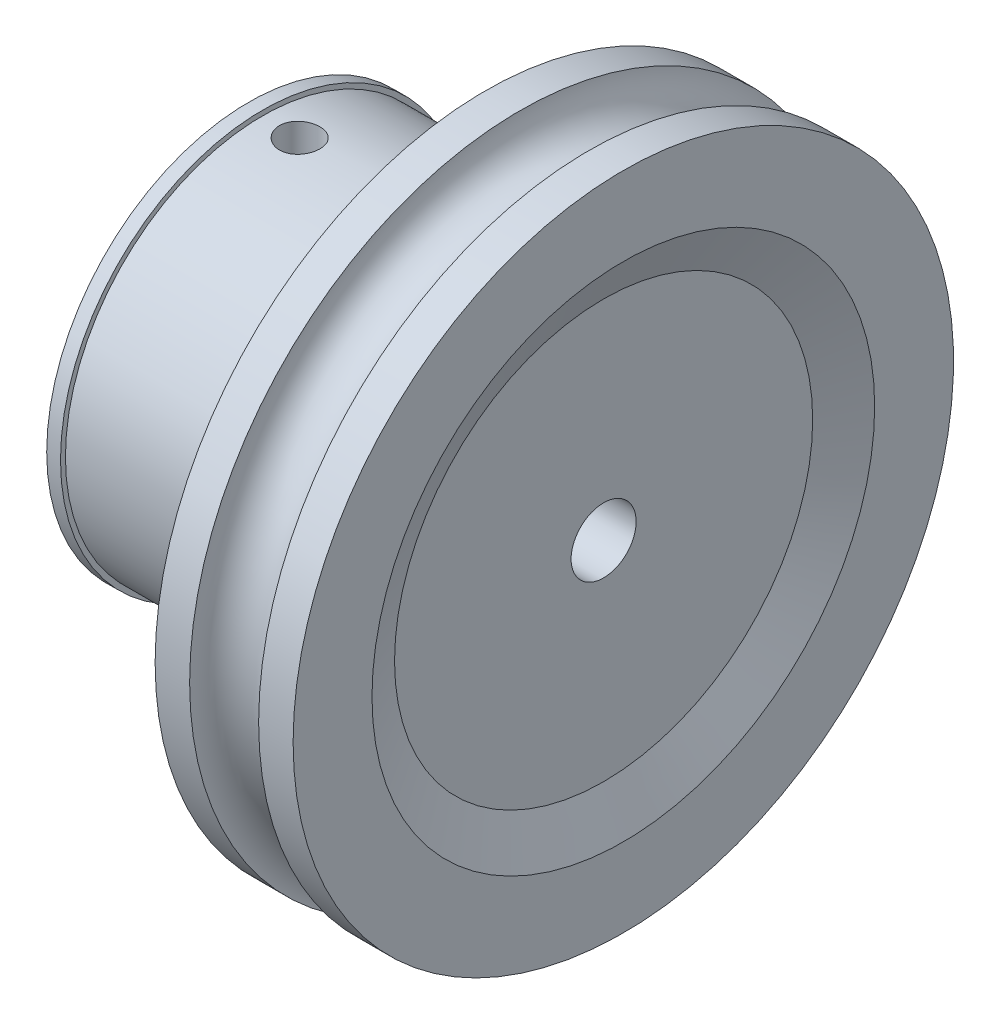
ISO-10303-21;
HEADER;
FILE_DESCRIPTION(('STEP AP214'),'2;1');
FILE_NAME('part.step','',(''),(''),'','','');
FILE_SCHEMA(('AUTOMOTIVE_DESIGN { 1 0 10303 214 1 1 1 1 }'));
ENDSEC;
DATA;
#1=APPLICATION_CONTEXT('core data for automotive mechanical design processes');
#2=APPLICATION_PROTOCOL_DEFINITION('international standard','automotive_design',2000,#1);
#3=PRODUCT_CONTEXT('',#1,'mechanical');
#4=PRODUCT('Part','Part','',(#3));
#5=PRODUCT_RELATED_PRODUCT_CATEGORY('part','',(#4));
#6=PRODUCT_DEFINITION_FORMATION('','',#4);
#7=PRODUCT_DEFINITION_CONTEXT('part definition',#1,'design');
#8=PRODUCT_DEFINITION('design','',#6,#7);
#9=PRODUCT_DEFINITION_SHAPE('','',#8);
#10=(LENGTH_UNIT() NAMED_UNIT(*) SI_UNIT(.MILLI.,.METRE.));
#11=(NAMED_UNIT(*) PLANE_ANGLE_UNIT() SI_UNIT($,.RADIAN.));
#12=(NAMED_UNIT(*) SI_UNIT($,.STERADIAN.) SOLID_ANGLE_UNIT());
#13=UNCERTAINTY_MEASURE_WITH_UNIT(LENGTH_MEASURE(1.E-05),#10,'distance_accuracy_value','');
#14=(GEOMETRIC_REPRESENTATION_CONTEXT(3) GLOBAL_UNCERTAINTY_ASSIGNED_CONTEXT((#13)) GLOBAL_UNIT_ASSIGNED_CONTEXT((#10,
#11,#12)) REPRESENTATION_CONTEXT('',''));
#15=CARTESIAN_POINT('',(0.,0.,0.));
#16=DIRECTION('',(0.,0.,1.));
#17=DIRECTION('',(1.,0.,0.));
#18=AXIS2_PLACEMENT_3D('',#15,#16,#17);
#19=CARTESIAN_POINT('',(18.,10.6054930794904,0.));
#20=DIRECTION('',(-1.,0.,0.));
#21=DIRECTION('',(0.,0.,1.));
#22=AXIS2_PLACEMENT_3D('',#19,#20,#21);
#23=PLANE('',#22);
#24=CARTESIAN_POINT('',(18.,0.,0.));
#25=DIRECTION('',(1.,0.,0.));
#26=DIRECTION('',(0.,0.,-1.));
#27=AXIS2_PLACEMENT_3D('',#24,#25,#26);
#28=CIRCLE('',#27,1.65);
#29=CARTESIAN_POINT('',(18.,0.,-1.65));
#30=VERTEX_POINT('',#29);
#31=EDGE_CURVE('E68',#30,#30,#28,.T.);
#32=ORIENTED_EDGE('',*,*,#31,.F.);
#33=EDGE_LOOP('',(#32));
#34=FACE_BOUND('',#33,.T.);
#35=CARTESIAN_POINT('',(18.,0.,0.));
#36=DIRECTION('',(-1.,0.,0.));
#37=DIRECTION('',(0.,0.,1.));
#38=AXIS2_PLACEMENT_3D('',#35,#36,#37);
#39=CIRCLE('',#38,10.6054930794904);
#40=CARTESIAN_POINT('',(18.,0.,10.6054930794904));
#41=VERTEX_POINT('',#40);
#42=EDGE_CURVE('E9',#41,#41,#39,.T.);
#43=ORIENTED_EDGE('',*,*,#42,.F.);
#44=EDGE_LOOP('',(#43));
#45=FACE_BOUND('',#44,.T.);
#46=ADVANCED_FACE('F15',(#34,#45),#23,.F.);
#47=CARTESIAN_POINT('',(18.,0.,0.));
#48=DIRECTION('',(1.,0.,0.));
#49=DIRECTION('',(0.,0.,-1.));
#50=AXIS2_PLACEMENT_3D('',#47,#48,#49);
#51=CONICAL_SURFACE('',#50,10.6054930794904,1.13446401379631);
#52=CARTESIAN_POINT('',(19.,0.,0.));
#53=DIRECTION('',(-1.,0.,0.));
#54=DIRECTION('',(0.,0.,1.));
#55=AXIS2_PLACEMENT_3D('',#52,#53,#54);
#56=CIRCLE('',#55,12.75);
#57=CARTESIAN_POINT('',(19.,0.,12.75));
#58=VERTEX_POINT('',#57);
#59=EDGE_CURVE('E26',#58,#58,#56,.T.);
#60=ORIENTED_EDGE('',*,*,#59,.F.);
#61=EDGE_LOOP('',(#60));
#62=FACE_BOUND('',#61,.T.);
#63=ORIENTED_EDGE('',*,*,#42,.T.);
#64=EDGE_LOOP('',(#63));
#65=FACE_BOUND('',#64,.T.);
#66=ADVANCED_FACE('F110',(#62,#65),#51,.F.);
#67=CARTESIAN_POINT('',(19.,16.75,0.));
#68=DIRECTION('',(-1.,0.,0.));
#69=DIRECTION('',(0.,0.,1.));
#70=AXIS2_PLACEMENT_3D('',#67,#68,#69);
#71=PLANE('',#70);
#72=CARTESIAN_POINT('',(19.,0.,0.));
#73=DIRECTION('',(-1.,0.,0.));
#74=DIRECTION('',(0.,0.,1.));
#75=AXIS2_PLACEMENT_3D('',#72,#73,#74);
#76=CIRCLE('',#75,16.75);
#77=CARTESIAN_POINT('',(19.,0.,16.75));
#78=VERTEX_POINT('',#77);
#79=EDGE_CURVE('E30',#78,#78,#76,.T.);
#80=ORIENTED_EDGE('',*,*,#79,.F.);
#81=EDGE_LOOP('',(#80));
#82=FACE_BOUND('',#81,.T.);
#83=ORIENTED_EDGE('',*,*,#59,.T.);
#84=EDGE_LOOP('',(#83));
#85=FACE_BOUND('',#84,.T.);
#86=ADVANCED_FACE('F116',(#82,#85),#71,.F.);
#87=CARTESIAN_POINT('',(0.,0.,0.));
#88=DIRECTION('',(-1.,0.,0.));
#89=DIRECTION('',(0.,0.,1.));
#90=AXIS2_PLACEMENT_3D('',#87,#88,#89);
#91=CYLINDRICAL_SURFACE('',#90,16.75);
#92=CARTESIAN_POINT('',(17.25,0.,0.));
#93=DIRECTION('',(-1.,0.,0.));
#94=DIRECTION('',(0.,0.,1.));
#95=AXIS2_PLACEMENT_3D('',#92,#93,#94);
#96=CIRCLE('',#95,16.75);
#97=CARTESIAN_POINT('',(17.25,0.,16.75));
#98=VERTEX_POINT('',#97);
#99=EDGE_CURVE('E35',#98,#98,#96,.T.);
#100=ORIENTED_EDGE('',*,*,#99,.F.);
#101=EDGE_LOOP('',(#100));
#102=FACE_BOUND('',#101,.T.);
#103=ORIENTED_EDGE('',*,*,#79,.T.);
#104=EDGE_LOOP('',(#103));
#105=FACE_BOUND('',#104,.T.);
#106=ADVANCED_FACE('F125',(#102,#105),#91,.T.);
#107=CARTESIAN_POINT('',(15.5,0.,0.));
#108=DIRECTION('',(-1.,0.,0.));
#109=DIRECTION('',(0.,0.,1.));
#110=AXIS2_PLACEMENT_3D('',#107,#108,#109);
#111=TOROIDAL_SURFACE('',#110,16.75,1.75);
#112=CARTESIAN_POINT('',(13.75,0.,0.));
#113=DIRECTION('',(-1.,0.,0.));
#114=DIRECTION('',(0.,0.,1.));
#115=AXIS2_PLACEMENT_3D('',#112,#113,#114);
#116=CIRCLE('',#115,16.75);
#117=CARTESIAN_POINT('',(13.75,0.,16.75));
#118=VERTEX_POINT('',#117);
#119=EDGE_CURVE('E38',#118,#118,#116,.T.);
#120=ORIENTED_EDGE('',*,*,#119,.F.);
#121=EDGE_LOOP('',(#120));
#122=FACE_BOUND('',#121,.T.);
#123=ORIENTED_EDGE('',*,*,#99,.T.);
#124=EDGE_LOOP('',(#123));
#125=FACE_BOUND('',#124,.T.);
#126=ADVANCED_FACE('F132',(#122,#125),#111,.F.);
#127=CARTESIAN_POINT('',(0.,0.,0.));
#128=DIRECTION('',(-1.,0.,0.));
#129=DIRECTION('',(0.,0.,1.));
#130=AXIS2_PLACEMENT_3D('',#127,#128,#129);
#131=CYLINDRICAL_SURFACE('',#130,16.75);
#132=CARTESIAN_POINT('',(12.,0.,0.));
#133=DIRECTION('',(-1.,0.,0.));
#134=DIRECTION('',(0.,0.,1.));
#135=AXIS2_PLACEMENT_3D('',#132,#133,#134);
#136=CIRCLE('',#135,16.75);
#137=CARTESIAN_POINT('',(12.,0.,16.75));
#138=VERTEX_POINT('',#137);
#139=EDGE_CURVE('E41',#138,#138,#136,.T.);
#140=ORIENTED_EDGE('',*,*,#139,.F.);
#141=EDGE_LOOP('',(#140));
#142=FACE_BOUND('',#141,.T.);
#143=ORIENTED_EDGE('',*,*,#119,.T.);
#144=EDGE_LOOP('',(#143));
#145=FACE_BOUND('',#144,.T.);
#146=ADVANCED_FACE('F136',(#142,#145),#131,.T.);
#147=CARTESIAN_POINT('',(12.,14.3,0.));
#148=DIRECTION('',(1.,0.,0.));
#149=DIRECTION('',(0.,0.,-1.));
#150=AXIS2_PLACEMENT_3D('',#147,#148,#149);
#151=PLANE('',#150);
#152=CARTESIAN_POINT('',(12.,0.,0.));
#153=DIRECTION('',(-1.,0.,0.));
#154=DIRECTION('',(0.,0.,1.));
#155=AXIS2_PLACEMENT_3D('',#152,#153,#154);
#156=CIRCLE('',#155,14.3);
#157=CARTESIAN_POINT('',(12.,0.,14.3));
#158=VERTEX_POINT('',#157);
#159=EDGE_CURVE('E44',#158,#158,#156,.T.);
#160=ORIENTED_EDGE('',*,*,#159,.F.);
#161=EDGE_LOOP('',(#160));
#162=FACE_BOUND('',#161,.T.);
#163=ORIENTED_EDGE('',*,*,#139,.T.);
#164=EDGE_LOOP('',(#163));
#165=FACE_BOUND('',#164,.T.);
#166=ADVANCED_FACE('F140',(#162,#165),#151,.F.);
#167=CARTESIAN_POINT('',(12.,0.,0.));
#168=DIRECTION('',(1.,0.,0.));
#169=DIRECTION('',(0.,0.,-1.));
#170=AXIS2_PLACEMENT_3D('',#167,#168,#169);
#171=CONICAL_SURFACE('',#170,14.3,0.785398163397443);
#172=CARTESIAN_POINT('',(9.7,0.,0.));
#173=DIRECTION('',(-1.,0.,0.));
#174=DIRECTION('',(0.,0.,1.));
#175=AXIS2_PLACEMENT_3D('',#172,#173,#174);
#176=CIRCLE('',#175,12.);
#177=CARTESIAN_POINT('',(9.7,0.,12.));
#178=VERTEX_POINT('',#177);
#179=EDGE_CURVE('E47',#178,#178,#176,.T.);
#180=ORIENTED_EDGE('',*,*,#179,.F.);
#181=EDGE_LOOP('',(#180));
#182=FACE_BOUND('',#181,.T.);
#183=ORIENTED_EDGE('',*,*,#159,.T.);
#184=EDGE_LOOP('',(#183));
#185=FACE_BOUND('',#184,.T.);
#186=ADVANCED_FACE('F144',(#182,#185),#171,.T.);
#187=CARTESIAN_POINT('',(0.,0.,0.));
#188=DIRECTION('',(-1.,0.,0.));
#189=DIRECTION('',(0.,0.,1.));
#190=AXIS2_PLACEMENT_3D('',#187,#188,#189);
#191=CYLINDRICAL_SURFACE('',#190,12.);
#192=CARTESIAN_POINT('',(8.7,0.,0.));
#193=DIRECTION('',(-1.,0.,0.));
#194=DIRECTION('',(0.,0.,1.));
#195=AXIS2_PLACEMENT_3D('',#192,#193,#194);
#196=CIRCLE('',#195,12.);
#197=CARTESIAN_POINT('',(8.7,0.,12.));
#198=VERTEX_POINT('',#197);
#199=EDGE_CURVE('E50',#198,#198,#196,.T.);
#200=ORIENTED_EDGE('',*,*,#199,.F.);
#201=EDGE_LOOP('',(#200));
#202=FACE_BOUND('',#201,.T.);
#203=ORIENTED_EDGE('',*,*,#179,.T.);
#204=EDGE_LOOP('',(#203));
#205=FACE_BOUND('',#204,.T.);
#206=ADVANCED_FACE('F148',(#202,#205),#191,.T.);
#207=CARTESIAN_POINT('',(8.7,10.,0.));
#208=DIRECTION('',(1.,0.,0.));
#209=DIRECTION('',(0.,0.,-1.));
#210=AXIS2_PLACEMENT_3D('',#207,#208,#209);
#211=PLANE('',#210);
#212=CARTESIAN_POINT('',(8.7,0.,0.));
#213=DIRECTION('',(-1.,0.,0.));
#214=DIRECTION('',(0.,0.,1.));
#215=AXIS2_PLACEMENT_3D('',#212,#213,#214);
#216=CIRCLE('',#215,10.);
#217=CARTESIAN_POINT('',(8.7,0.,10.));
#218=VERTEX_POINT('',#217);
#219=EDGE_CURVE('E53',#218,#218,#216,.T.);
#220=ORIENTED_EDGE('',*,*,#219,.F.);
#221=EDGE_LOOP('',(#220));
#222=FACE_BOUND('',#221,.T.);
#223=ORIENTED_EDGE('',*,*,#199,.T.);
#224=EDGE_LOOP('',(#223));
#225=FACE_BOUND('',#224,.T.);
#226=ADVANCED_FACE('F105',(#222,#225),#211,.F.);
#227=CARTESIAN_POINT('',(0.,0.,0.));
#228=DIRECTION('',(-1.,0.,0.));
#229=DIRECTION('',(0.,0.,1.));
#230=AXIS2_PLACEMENT_3D('',#227,#228,#229);
#231=CYLINDRICAL_SURFACE('',#230,10.);
#232=CARTESIAN_POINT('',(2.58364123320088,9.94733004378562,1.025));
#233=CARTESIAN_POINT('',(2.52622902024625,9.94733073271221,1.02499751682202));
#234=CARTESIAN_POINT('',(2.46877903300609,9.94783244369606,1.02016009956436));
#235=CARTESIAN_POINT('',(2.35547242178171,9.94978475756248,1.00093607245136));
#236=CARTESIAN_POINT('',(2.29961761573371,9.95123640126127,0.986538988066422));
#237=CARTESIAN_POINT('',(2.19115859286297,9.95492246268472,0.948619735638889));
#238=CARTESIAN_POINT('',(2.13855240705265,9.9571564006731,0.925103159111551));
#239=CARTESIAN_POINT('',(2.03804502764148,9.96215475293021,0.869623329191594));
#240=CARTESIAN_POINT('',(1.99014291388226,9.96491906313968,0.837661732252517));
#241=CARTESIAN_POINT('',(1.90020957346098,9.97067849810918,0.76606825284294));
#242=CARTESIAN_POINT('',(1.85819881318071,9.97367437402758,0.726410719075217));
#243=CARTESIAN_POINT('',(1.78141699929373,9.97955256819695,0.640605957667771));
#244=CARTESIAN_POINT('',(1.74664627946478,9.98243488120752,0.594458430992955));
#245=CARTESIAN_POINT('',(1.6852605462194,9.9877686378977,0.496857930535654));
#246=CARTESIAN_POINT('',(1.65866368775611,9.99021911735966,0.445393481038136));
#247=CARTESIAN_POINT('',(1.61449682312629,9.99440492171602,0.338699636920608));
#248=CARTESIAN_POINT('',(1.59692658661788,9.99614026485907,0.283470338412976));
#249=CARTESIAN_POINT('',(1.57137186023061,9.9986949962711,0.171021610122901));
#250=CARTESIAN_POINT('',(1.56335371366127,9.9995175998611,0.113809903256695));
#251=CARTESIAN_POINT('',(1.55702661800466,10.0001651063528,-0.0011526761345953));
#252=CARTESIAN_POINT('',(1.55871740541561,9.99999003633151,-0.0589035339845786));
#253=CARTESIAN_POINT('',(1.57173289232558,9.99866455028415,-0.173076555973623));
#254=CARTESIAN_POINT('',(1.58302140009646,9.99751779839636,-0.229502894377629));
#255=CARTESIAN_POINT('',(1.61485548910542,9.99438201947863,-0.339655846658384));
#256=CARTESIAN_POINT('',(1.63540119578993,9.99239298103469,-0.393382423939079));
#257=CARTESIAN_POINT('',(1.68520603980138,9.98778993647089,-0.496724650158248));
#258=CARTESIAN_POINT('',(1.71448116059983,9.98517478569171,-0.546332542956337));
#259=CARTESIAN_POINT('',(1.780902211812,9.97961288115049,-0.639944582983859));
#260=CARTESIAN_POINT('',(1.81804838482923,9.9766661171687,-0.683948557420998));
#261=CARTESIAN_POINT('',(1.89936056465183,9.97075560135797,-0.76531568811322));
#262=CARTESIAN_POINT('',(1.94355806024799,9.96779183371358,-0.80264738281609));
#263=CARTESIAN_POINT('',(2.03760919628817,9.96219485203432,-0.869366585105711));
#264=CARTESIAN_POINT('',(2.08746284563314,9.95956163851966,-0.898754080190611));
#265=CARTESIAN_POINT('',(2.19143565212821,9.95492369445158,-0.948750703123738));
#266=CARTESIAN_POINT('',(2.24555577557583,9.95291910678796,-0.969357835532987));
#267=CARTESIAN_POINT('',(2.35651307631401,9.94976831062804,-1.00118360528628));
#268=CARTESIAN_POINT('',(2.4133501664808,9.94862207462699,-1.0124025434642));
#269=CARTESIAN_POINT('',(2.52785165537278,9.94732254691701,-1.02509288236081));
#270=CARTESIAN_POINT('',(2.58551112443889,9.94716476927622,-1.02660832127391));
#271=CARTESIAN_POINT('',(2.70026317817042,9.94784818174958,-1.01996434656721));
#272=CARTESIAN_POINT('',(2.75735577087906,9.94868935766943,-1.01180507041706));
#273=CARTESIAN_POINT('',(2.86922473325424,9.95127181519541,-0.986080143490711));
#274=CARTESIAN_POINT('',(2.92400595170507,9.95301109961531,-0.968535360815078));
#275=CARTESIAN_POINT('',(3.02984793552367,9.95719217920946,-0.924558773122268));
#276=CARTESIAN_POINT('',(3.08090861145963,9.9596339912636,-0.898126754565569));
#277=CARTESIAN_POINT('',(3.17806067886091,9.96495584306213,-0.837015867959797));
#278=CARTESIAN_POINT('',(3.22413364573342,9.96783741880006,-0.802307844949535));
#279=CARTESIAN_POINT('',(3.30981551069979,9.97370910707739,-0.725671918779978));
#280=CARTESIAN_POINT('',(3.34942424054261,9.97669922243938,-0.68374382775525));
#281=CARTESIAN_POINT('',(3.42120540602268,9.98246464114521,-0.593666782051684));
#282=CARTESIAN_POINT('',(3.45334909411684,9.98523908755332,-0.545494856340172));
#283=CARTESIAN_POINT('',(3.50908981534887,9.9902480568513,-0.44441086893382));
#284=CARTESIAN_POINT('',(3.53268697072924,9.99248258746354,-0.391498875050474));
#285=CARTESIAN_POINT('',(3.5706161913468,9.99615608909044,-0.28253664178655));
#286=CARTESIAN_POINT('',(3.58496555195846,9.99759654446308,-0.226492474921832));
#287=CARTESIAN_POINT('',(3.6040482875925,9.99952569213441,-0.112774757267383));
#288=CARTESIAN_POINT('',(3.60878194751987,10.0000144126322,-0.0551012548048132));
#289=CARTESIAN_POINT('',(3.60849478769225,9.99998499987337,0.0599557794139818));
#290=CARTESIAN_POINT('',(3.60351856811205,9.99947147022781,0.117339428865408));
#291=CARTESIAN_POINT('',(3.58404651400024,9.9975043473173,0.230450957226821));
#292=CARTESIAN_POINT('',(3.56955067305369,9.99605075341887,0.286178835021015));
#293=CARTESIAN_POINT('',(3.53146337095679,9.99236633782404,0.394396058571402));
#294=CARTESIAN_POINT('',(3.50787329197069,9.99013563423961,0.446885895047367));
#295=CARTESIAN_POINT('',(3.45227188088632,9.98514550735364,0.547168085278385));
#296=CARTESIAN_POINT('',(3.42026058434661,9.98238608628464,0.594960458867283));
#297=CARTESIAN_POINT('',(3.34855833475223,9.97663240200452,0.684719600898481));
#298=CARTESIAN_POINT('',(3.30883416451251,9.97363715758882,0.726659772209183));
#299=CARTESIAN_POINT('',(3.22289976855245,9.9677576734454,0.803298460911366));
#300=CARTESIAN_POINT('',(3.17668799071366,9.96487346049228,0.837995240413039));
#301=CARTESIAN_POINT('',(3.07895498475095,9.95953439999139,0.899235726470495));
#302=CARTESIAN_POINT('',(3.02741997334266,9.95708071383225,0.925757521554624));
#303=CARTESIAN_POINT('',(2.92063534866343,9.95289433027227,0.969735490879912));
#304=CARTESIAN_POINT('',(2.86538999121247,9.95116082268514,0.987201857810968));
#305=CARTESIAN_POINT('',(2.77213531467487,9.94904678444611,1.00823313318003));
#306=CARTESIAN_POINT('',(2.73472153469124,9.94840606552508,1.01451207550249));
#307=CARTESIAN_POINT('',(2.65942439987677,9.94754746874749,1.02289631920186));
#308=CARTESIAN_POINT('',(2.62154104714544,9.94732958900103,1.02500163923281));
#309=CARTESIAN_POINT('',(2.58364123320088,9.94733004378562,1.025));
#310=B_SPLINE_CURVE_WITH_KNOTS('',3,(#232,#233,#234,#235,#236,#237,#238,#239,#240,#241,#242,
#243,#244,#245,#246,#247,#248,#249,#250,#251,#252,#253,#254,#255,#256,#257,#258,#259,#260,#261,
#262,#263,#264,#265,#266,#267,#268,#269,#270,#271,#272,#273,#274,#275,#276,#277,#278,#279,#280,
#281,#282,#283,#284,#285,#286,#287,#288,#289,#290,#291,#292,#293,#294,#295,#296,#297,#298,#299,
#300,#301,#302,#303,#304,#305,#306,#307,#308,#309),.UNSPECIFIED.,.T.,.F.,(4,2,2,2,2,2,2,2,2,2,2,
2,2,2,2,2,2,2,2,2,2,2,2,2,2,2,2,2,2,2,2,2,2,2,2,2,2,2,4),(0.,0.172098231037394,0.34438534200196,
0.516566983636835,0.688714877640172,0.861446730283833,1.03418654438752,1.20730730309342,
1.38042364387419,1.55292818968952,1.72542805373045,1.89728031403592,2.06913490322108,
2.2413061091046,2.41348262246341,2.5864507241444,2.75941909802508,2.93242676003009,
3.10542887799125,3.27764528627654,3.44985924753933,3.6216918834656,3.79352864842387,
3.96597994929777,4.13843573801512,4.31154502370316,4.48465183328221,4.65743394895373,
4.83021094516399,5.00219619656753,5.17418156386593,5.34614080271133,5.51809931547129,
5.69081552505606,5.86357312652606,6.03678982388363,6.209811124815,6.3234197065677,
6.43702778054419),.UNSPECIFIED.);
#311=CARTESIAN_POINT('',(2.58364123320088,9.94733004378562,1.025));
#312=VERTEX_POINT('',#311);
#313=EDGE_CURVE('E71',#312,#312,#310,.T.);
#314=ORIENTED_EDGE('',*,*,#313,.T.);
#315=EDGE_LOOP('',(#314));
#316=FACE_BOUND('',#315,.T.);
#317=CARTESIAN_POINT('',(0.7,0.,0.));
#318=DIRECTION('',(-1.,0.,0.));
#319=DIRECTION('',(0.,0.,1.));
#320=AXIS2_PLACEMENT_3D('',#317,#318,#319);
#321=CIRCLE('',#320,10.);
#322=CARTESIAN_POINT('',(0.7,0.,10.));
#323=VERTEX_POINT('',#322);
#324=EDGE_CURVE('E56',#323,#323,#321,.T.);
#325=ORIENTED_EDGE('',*,*,#324,.F.);
#326=EDGE_LOOP('',(#325));
#327=FACE_BOUND('',#326,.T.);
#328=ORIENTED_EDGE('',*,*,#219,.T.);
#329=EDGE_LOOP('',(#328));
#330=FACE_BOUND('',#329,.T.);
#331=ADVANCED_FACE('F76',(#316,#327,#330),#231,.T.);
#332=CARTESIAN_POINT('',(0.7,10.25,0.));
#333=DIRECTION('',(-1.,0.,0.));
#334=DIRECTION('',(0.,0.,1.));
#335=AXIS2_PLACEMENT_3D('',#332,#333,#334);
#336=PLANE('',#335);
#337=CARTESIAN_POINT('',(0.7,0.,0.));
#338=DIRECTION('',(-1.,0.,0.));
#339=DIRECTION('',(0.,0.,1.));
#340=AXIS2_PLACEMENT_3D('',#337,#338,#339);
#341=CIRCLE('',#340,10.25);
#342=CARTESIAN_POINT('',(0.7,0.,10.25));
#343=VERTEX_POINT('',#342);
#344=EDGE_CURVE('E59',#343,#343,#341,.T.);
#345=ORIENTED_EDGE('',*,*,#344,.F.);
#346=EDGE_LOOP('',(#345));
#347=FACE_BOUND('',#346,.T.);
#348=ORIENTED_EDGE('',*,*,#324,.T.);
#349=EDGE_LOOP('',(#348));
#350=FACE_BOUND('',#349,.T.);
#351=ADVANCED_FACE('F96',(#347,#350),#336,.F.);
#352=CARTESIAN_POINT('',(0.,0.,0.));
#353=DIRECTION('',(-1.,0.,0.));
#354=DIRECTION('',(0.,0.,1.));
#355=AXIS2_PLACEMENT_3D('',#352,#353,#354);
#356=CYLINDRICAL_SURFACE('',#355,10.25);
#357=CARTESIAN_POINT('',(0.,0.,0.));
#358=DIRECTION('',(-1.,0.,0.));
#359=DIRECTION('',(0.,0.,1.));
#360=AXIS2_PLACEMENT_3D('',#357,#358,#359);
#361=CIRCLE('',#360,10.25);
#362=CARTESIAN_POINT('',(0.,0.,10.25));
#363=VERTEX_POINT('',#362);
#364=EDGE_CURVE('E62',#363,#363,#361,.T.);
#365=ORIENTED_EDGE('',*,*,#364,.F.);
#366=EDGE_LOOP('',(#365));
#367=FACE_BOUND('',#366,.T.);
#368=ORIENTED_EDGE('',*,*,#344,.T.);
#369=EDGE_LOOP('',(#368));
#370=FACE_BOUND('',#369,.T.);
#371=ADVANCED_FACE('F93',(#367,#370),#356,.T.);
#372=CARTESIAN_POINT('',(0.,0.,0.));
#373=DIRECTION('',(1.,0.,0.));
#374=DIRECTION('',(0.,0.,-1.));
#375=AXIS2_PLACEMENT_3D('',#372,#373,#374);
#376=PLANE('',#375);
#377=CARTESIAN_POINT('',(0.,0.,0.));
#378=DIRECTION('',(1.,0.,0.));
#379=DIRECTION('',(0.,0.,-1.));
#380=AXIS2_PLACEMENT_3D('',#377,#378,#379);
#381=CIRCLE('',#380,1.65);
#382=CARTESIAN_POINT('',(0.,0.,-1.65));
#383=VERTEX_POINT('',#382);
#384=EDGE_CURVE('E65',#383,#383,#381,.T.);
#385=ORIENTED_EDGE('',*,*,#384,.T.);
#386=EDGE_LOOP('',(#385));
#387=FACE_BOUND('',#386,.T.);
#388=ORIENTED_EDGE('',*,*,#364,.T.);
#389=EDGE_LOOP('',(#388));
#390=FACE_BOUND('',#389,.T.);
#391=ADVANCED_FACE('F89',(#387,#390),#376,.F.);
#392=CARTESIAN_POINT('',(18.,0.,0.));
#393=DIRECTION('',(1.,0.,0.));
#394=DIRECTION('',(0.,0.,-1.));
#395=AXIS2_PLACEMENT_3D('',#392,#393,#394);
#396=CYLINDRICAL_SURFACE('',#395,1.65);
#397=CARTESIAN_POINT('',(2.58364123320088,1.29301005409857,1.025));
#398=CARTESIAN_POINT('',(2.6346598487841,1.29301662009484,1.0249958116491));
#399=CARTESIAN_POINT('',(2.685761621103,1.29608590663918,1.02115613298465));
#400=CARTESIAN_POINT('',(2.78625243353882,1.30782676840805,1.00606826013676));
#401=CARTESIAN_POINT('',(2.83563629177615,1.31651396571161,0.994799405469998));
#402=CARTESIAN_POINT('',(2.93093188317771,1.33803746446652,0.965648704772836));
#403=CARTESIAN_POINT('',(2.97686943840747,1.35083807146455,0.947823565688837));
#404=CARTESIAN_POINT('',(3.06504339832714,1.3790846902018,0.906231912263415));
#405=CARTESIAN_POINT('',(3.1072797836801,1.3945307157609,0.882465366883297));
#406=CARTESIAN_POINT('',(3.19300104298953,1.42879376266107,0.826000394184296));
#407=CARTESIAN_POINT('',(3.23591151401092,1.44778638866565,0.792536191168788));
#408=CARTESIAN_POINT('',(3.31599593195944,1.48558817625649,0.719189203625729));
#409=CARTESIAN_POINT('',(3.35316492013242,1.50439716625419,0.679300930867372));
#410=CARTESIAN_POINT('',(3.42508012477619,1.54235333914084,0.588508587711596));
#411=CARTESIAN_POINT('',(3.45901566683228,1.56127587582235,0.536859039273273));
#412=CARTESIAN_POINT('',(3.51744378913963,1.59476933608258,0.427183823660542));
#413=CARTESIAN_POINT('',(3.54194562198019,1.60934452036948,0.369164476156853));
#414=CARTESIAN_POINT('',(3.57815635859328,1.63118035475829,0.254563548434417));
#415=CARTESIAN_POINT('',(3.59090522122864,1.63902987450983,0.198425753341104));
#416=CARTESIAN_POINT('',(3.60678481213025,1.64883491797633,0.0843199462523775));
#417=CARTESIAN_POINT('',(3.60992548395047,1.6507965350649,0.0263538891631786));
#418=CARTESIAN_POINT('',(3.60663016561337,1.64875187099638,-0.0814552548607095));
#419=CARTESIAN_POINT('',(3.60140914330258,1.64550264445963,-0.131355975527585));
#420=CARTESIAN_POINT('',(3.5838791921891,1.63471803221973,-0.22941030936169));
#421=CARTESIAN_POINT('',(3.57156972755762,1.62718232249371,-0.277563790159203));
#422=CARTESIAN_POINT('',(3.54038705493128,1.60844098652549,-0.371082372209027));
#423=CARTESIAN_POINT('',(3.52149366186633,1.59722408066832,-0.416438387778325));
#424=CARTESIAN_POINT('',(3.47784867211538,1.57199401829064,-0.503374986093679));
#425=CARTESIAN_POINT('',(3.45309571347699,1.55798021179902,-0.544954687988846));
#426=CARTESIAN_POINT('',(3.39499678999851,1.52627235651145,-0.628677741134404));
#427=CARTESIAN_POINT('',(3.36096656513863,1.5083374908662,-0.670254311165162));
#428=CARTESIAN_POINT('',(3.28704525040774,1.47160536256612,-0.747469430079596));
#429=CARTESIAN_POINT('',(3.24714572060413,1.45280688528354,-0.783099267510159));
#430=CARTESIAN_POINT('',(3.15659206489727,1.41360133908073,-0.85205390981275));
#431=CARTESIAN_POINT('',(3.10521488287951,1.39329747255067,-0.884495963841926));
#432=CARTESIAN_POINT('',(2.99649810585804,1.3563680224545,-0.940151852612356));
#433=CARTESIAN_POINT('',(2.93916976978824,1.33973567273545,-0.963382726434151));
#434=CARTESIAN_POINT('',(2.83541559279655,1.3165936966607,-0.994663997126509));
#435=CARTESIAN_POINT('',(2.79004515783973,1.30857537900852,-1.00509329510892));
#436=CARTESIAN_POINT('',(2.6977570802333,1.29723215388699,-1.01969486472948));
#437=CARTESIAN_POINT('',(2.65084158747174,1.2939009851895,-1.02387548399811));
#438=CARTESIAN_POINT('',(2.55669758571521,1.29243244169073,-1.02572921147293));
#439=CARTESIAN_POINT('',(2.50946862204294,1.29430618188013,-1.02338839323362));
#440=CARTESIAN_POINT('',(2.41621408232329,1.30297517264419,-1.0123251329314));
#441=CARTESIAN_POINT('',(2.37018953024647,1.30977447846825,-1.00359743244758));
#442=CARTESIAN_POINT('',(2.28112367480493,1.32721700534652,-0.980407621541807));
#443=CARTESIAN_POINT('',(2.2380496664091,1.33780517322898,-0.966027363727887));
#444=CARTESIAN_POINT('',(2.15481700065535,1.36167993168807,-0.932071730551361));
#445=CARTESIAN_POINT('',(2.11465939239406,1.37496748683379,-0.912494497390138));
#446=CARTESIAN_POINT('',(2.03034100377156,1.40577231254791,-0.864443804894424));
#447=CARTESIAN_POINT('',(1.98685837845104,1.42361433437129,-0.834988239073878));
#448=CARTESIAN_POINT('',(1.90497755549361,1.45983219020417,-0.769921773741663));
#449=CARTESIAN_POINT('',(1.86658465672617,1.47820855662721,-0.734304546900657));
#450=CARTESIAN_POINT('',(1.78990550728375,1.51678231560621,-0.651362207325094));
#451=CARTESIAN_POINT('',(1.7525638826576,1.53681863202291,-0.603077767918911));
#452=CARTESIAN_POINT('',(1.68660226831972,1.57346849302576,-0.499697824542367));
#453=CARTESIAN_POINT('',(1.65797788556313,1.59008376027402,-0.444605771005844));
#454=CARTESIAN_POINT('',(1.61231812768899,1.61710443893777,-0.332541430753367));
#455=CARTESIAN_POINT('',(1.59467369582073,1.62783128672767,-0.275898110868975));
#456=CARTESIAN_POINT('',(1.56941255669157,1.64329926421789,-0.15965321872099));
#457=CARTESIAN_POINT('',(1.56178237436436,1.6480484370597,-0.10005573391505));
#458=CARTESIAN_POINT('',(1.55741903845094,1.65075966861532,0.0109614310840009));
#459=CARTESIAN_POINT('',(1.5592619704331,1.64960866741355,0.0623093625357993));
#460=CARTESIAN_POINT('',(1.57053226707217,1.64263346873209,0.163835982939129));
#461=CARTESIAN_POINT('',(1.5799593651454,1.63680943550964,0.21401471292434));
#462=CARTESIAN_POINT('',(1.60549094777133,1.62128180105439,0.31024061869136));
#463=CARTESIAN_POINT('',(1.62137455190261,1.61170687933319,0.356368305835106));
#464=CARTESIAN_POINT('',(1.65914519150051,1.58944503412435,0.445271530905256));
#465=CARTESIAN_POINT('',(1.68103327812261,1.57675756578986,0.488046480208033));
#466=CARTESIAN_POINT('',(1.73272972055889,1.54771450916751,0.573883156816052));
#467=CARTESIAN_POINT('',(1.76312751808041,1.53111391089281,0.616505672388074));
#468=CARTESIAN_POINT('',(1.82970560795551,1.49649087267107,0.696357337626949));
#469=CARTESIAN_POINT('',(1.86589248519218,1.47846682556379,0.733580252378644));
#470=CARTESIAN_POINT('',(1.94896028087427,1.43984449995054,0.80703273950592));
#471=CARTESIAN_POINT('',(1.99662997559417,1.41924348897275,0.842373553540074));
#472=CARTESIAN_POINT('',(2.09807073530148,1.38038713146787,0.90464344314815));
#473=CARTESIAN_POINT('',(2.15183809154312,1.36213037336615,0.931577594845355));
#474=CARTESIAN_POINT('',(2.25208490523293,1.33417711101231,0.971041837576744));
#475=CARTESIAN_POINT('',(2.29754966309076,1.32348049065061,0.985439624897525));
#476=CARTESIAN_POINT('',(2.39075772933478,1.30652274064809,1.00781975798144));
#477=CARTESIAN_POINT('',(2.4384932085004,1.30024740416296,1.0158226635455));
#478=CARTESIAN_POINT('',(2.5027758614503,1.29543563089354,1.02193377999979));
#479=CARTESIAN_POINT('',(2.5189101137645,1.29452876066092,1.02308186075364));
#480=CARTESIAN_POINT('',(2.55124051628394,1.29331485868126,1.02461572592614));
#481=CARTESIAN_POINT('',(2.56743668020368,1.29300796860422,1.02500133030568));
#482=CARTESIAN_POINT('',(2.58364123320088,1.29301005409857,1.025));
#483=B_SPLINE_CURVE_WITH_KNOTS('',3,(#397,#398,#399,#400,#401,#402,#403,#404,#405,#406,#407,
#408,#409,#410,#411,#412,#413,#414,#415,#416,#417,#418,#419,#420,#421,#422,#423,#424,#425,#426,
#427,#428,#429,#430,#431,#432,#433,#434,#435,#436,#437,#438,#439,#440,#441,#442,#443,#444,#445,
#446,#447,#448,#449,#450,#451,#452,#453,#454,#455,#456,#457,#458,#459,#460,#461,#462,#463,#464,
#465,#466,#467,#468,#469,#470,#471,#472,#473,#474,#475,#476,#477,#478,#479,#480,#481,#482),
.UNSPECIFIED.,.T.,.F.,(4,2,2,2,2,2,2,2,2,2,2,2,2,2,2,2,2,2,2,2,2,2,2,2,2,2,2,2,2,2,2,2,2,2,2,2,
2,2,2,2,2,2,4),(0.,0.152981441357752,0.30639012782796,0.458502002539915,0.610614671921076,
0.782856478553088,0.955246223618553,1.14808930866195,1.3407427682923,1.5139918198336,
1.68706151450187,1.83717575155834,1.98730133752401,2.13789128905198,2.28851627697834,
2.45777767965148,2.62728489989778,2.81854754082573,3.00945470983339,3.15057835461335,
3.29151330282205,3.43274944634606,3.57410200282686,3.71347892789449,3.85290574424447,
4.0186877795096,4.18464107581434,4.37639587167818,4.56805387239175,4.74781547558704,
4.9273349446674,5.0807357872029,5.23413123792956,5.38266966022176,5.53123410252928,
5.69535897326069,5.85967187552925,6.04727655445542,6.23476773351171,6.38083162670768,
6.52642400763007,6.57500256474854,6.62359259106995),.UNSPECIFIED.);
#484=CARTESIAN_POINT('',(2.58364123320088,1.29301005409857,1.025));
#485=VERTEX_POINT('',#484);
#486=EDGE_CURVE('E18',#485,#485,#483,.T.);
#487=ORIENTED_EDGE('',*,*,#486,.T.);
#488=EDGE_LOOP('',(#487));
#489=FACE_BOUND('',#488,.T.);
#490=ORIENTED_EDGE('',*,*,#384,.F.);
#491=EDGE_LOOP('',(#490));
#492=FACE_BOUND('',#491,.T.);
#493=ORIENTED_EDGE('',*,*,#31,.T.);
#494=EDGE_LOOP('',(#493));
#495=FACE_BOUND('',#494,.T.);
#496=ADVANCED_FACE('F83',(#489,#492,#495),#396,.F.);
#497=CARTESIAN_POINT('',(2.58364123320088,10.,0.));
#498=DIRECTION('',(0.,1.,0.));
#499=DIRECTION('',(0.,0.,1.));
#500=AXIS2_PLACEMENT_3D('',#497,#498,#499);
#501=CYLINDRICAL_SURFACE('',#500,1.025);
#502=ORIENTED_EDGE('',*,*,#486,.F.);
#503=EDGE_LOOP('',(#502));
#504=FACE_BOUND('',#503,.T.);
#505=ORIENTED_EDGE('',*,*,#313,.F.);
#506=EDGE_LOOP('',(#505));
#507=FACE_BOUND('',#506,.T.);
#508=ADVANCED_FACE('F80',(#504,#507),#501,.F.);
#509=CLOSED_SHELL('',(#46,#66,#86,#106,#126,#146,#166,#186,#206,#226,#331,#351,#371,#391,#496,#508));
#510=MANIFOLD_SOLID_BREP('B1',#509);
#511=ADVANCED_BREP_SHAPE_REPRESENTATION('',(#18,#510),#14);
#512=SHAPE_DEFINITION_REPRESENTATION(#9,#511);
ENDSEC;
END-ISO-10303-21;
